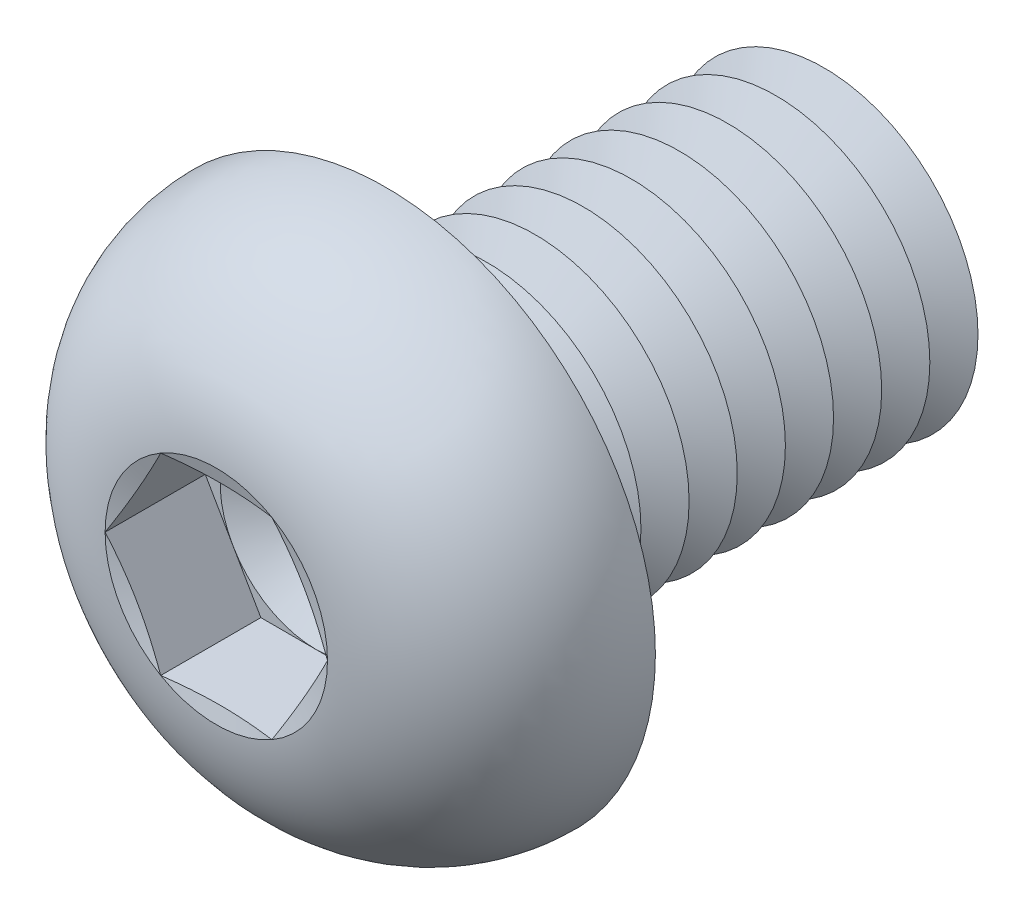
ISO-10303-21;
HEADER;
FILE_DESCRIPTION(('STEP AP214'),'2;1');
FILE_NAME('part.step','',(''),(''),'','','');
FILE_SCHEMA(('AUTOMOTIVE_DESIGN { 1 0 10303 214 1 1 1 1 }'));
ENDSEC;
DATA;
#1=APPLICATION_CONTEXT('core data for automotive mechanical design processes');
#2=APPLICATION_PROTOCOL_DEFINITION('international standard','automotive_design',2000,#1);
#3=PRODUCT_CONTEXT('',#1,'mechanical');
#4=PRODUCT('Part','Part','',(#3));
#5=PRODUCT_RELATED_PRODUCT_CATEGORY('part','',(#4));
#6=PRODUCT_DEFINITION_FORMATION('','',#4);
#7=PRODUCT_DEFINITION_CONTEXT('part definition',#1,'design');
#8=PRODUCT_DEFINITION('design','',#6,#7);
#9=PRODUCT_DEFINITION_SHAPE('','',#8);
#10=(LENGTH_UNIT() NAMED_UNIT(*) SI_UNIT(.MILLI.,.METRE.));
#11=(NAMED_UNIT(*) PLANE_ANGLE_UNIT() SI_UNIT($,.RADIAN.));
#12=(NAMED_UNIT(*) SI_UNIT($,.STERADIAN.) SOLID_ANGLE_UNIT());
#13=UNCERTAINTY_MEASURE_WITH_UNIT(LENGTH_MEASURE(1.E-05),#10,'distance_accuracy_value','');
#14=(GEOMETRIC_REPRESENTATION_CONTEXT(3) GLOBAL_UNCERTAINTY_ASSIGNED_CONTEXT((#13)) GLOBAL_UNIT_ASSIGNED_CONTEXT((#10,
#11,#12)) REPRESENTATION_CONTEXT('',''));
#15=CARTESIAN_POINT('',(0.,0.,0.));
#16=DIRECTION('',(0.,0.,1.));
#17=DIRECTION('',(1.,0.,0.));
#18=AXIS2_PLACEMENT_3D('',#15,#16,#17);
#19=CARTESIAN_POINT('',(0.,0.,1.8));
#20=DIRECTION('',(0.,0.,1.));
#21=DIRECTION('',(1.,0.,0.));
#22=AXIS2_PLACEMENT_3D('',#19,#20,#21);
#23=PLANE('',#22);
#24=CARTESIAN_POINT('',(0.,0.,1.8));
#25=DIRECTION('',(0.,0.,1.));
#26=DIRECTION('',(1.,0.,0.));
#27=AXIS2_PLACEMENT_3D('',#24,#25,#26);
#28=CIRCLE('',#27,2.49999883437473);
#29=CARTESIAN_POINT('',(2.1650625,1.24999941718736,1.8));
#30=VERTEX_POINT('',#29);
#31=CARTESIAN_POINT('',(0.,2.49999883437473,1.8));
#32=VERTEX_POINT('',#31);
#33=EDGE_CURVE('E118',#30,#32,#28,.T.);
#34=ORIENTED_EDGE('',*,*,#33,.F.);
#35=DIRECTION('',(-0.5,0.866025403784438,0.));
#36=VECTOR('',#35,1.);
#37=CARTESIAN_POINT('',(2.88675,0.,1.8));
#38=LINE('',#37,#36);
#39=CARTESIAN_POINT('',(1.443375,2.49999883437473,1.8));
#40=VERTEX_POINT('',#39);
#41=EDGE_CURVE('E125',#30,#40,#38,.T.);
#42=ORIENTED_EDGE('',*,*,#41,.T.);
#43=DIRECTION('',(-1.,0.,0.));
#44=VECTOR('',#43,1.);
#45=CARTESIAN_POINT('',(1.443375,2.49999883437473,1.8));
#46=LINE('',#45,#44);
#47=EDGE_CURVE('E136',#40,#32,#46,.T.);
#48=ORIENTED_EDGE('',*,*,#47,.T.);
#49=EDGE_LOOP('',(#34,#42,#48));
#50=FACE_BOUND('',#49,.T.);
#51=ADVANCED_FACE('F39',(#50),#23,.T.);
#52=CARTESIAN_POINT('',(0.,0.,1.8));
#53=DIRECTION('',(0.,0.,1.));
#54=DIRECTION('',(1.,0.,0.));
#55=AXIS2_PLACEMENT_3D('',#52,#53,#54);
#56=CIRCLE('',#55,2.49999883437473);
#57=CARTESIAN_POINT('',(-2.1650625,1.24999941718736,1.8));
#58=VERTEX_POINT('',#57);
#59=EDGE_CURVE('E11',#32,#58,#56,.T.);
#60=ORIENTED_EDGE('',*,*,#59,.F.);
#61=CARTESIAN_POINT('',(-1.443375,2.49999883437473,1.8));
#62=VERTEX_POINT('',#61);
#63=EDGE_CURVE('E131',#32,#62,#46,.T.);
#64=ORIENTED_EDGE('',*,*,#63,.T.);
#65=DIRECTION('',(-0.5,-0.866025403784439,0.));
#66=VECTOR('',#65,1.);
#67=CARTESIAN_POINT('',(-1.443375,2.49999883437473,1.8));
#68=LINE('',#67,#66);
#69=EDGE_CURVE('E134',#62,#58,#68,.T.);
#70=ORIENTED_EDGE('',*,*,#69,.T.);
#71=EDGE_LOOP('',(#60,#64,#70));
#72=FACE_BOUND('',#71,.T.);
#73=ADVANCED_FACE('F130',(#72),#23,.T.);
#74=CARTESIAN_POINT('',(-2.1650625,-1.24999941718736,1.8));
#75=VERTEX_POINT('',#74);
#76=EDGE_CURVE('E49',#58,#75,#56,.T.);
#77=ORIENTED_EDGE('',*,*,#76,.F.);
#78=CARTESIAN_POINT('',(-2.88675,0.,1.8));
#79=VERTEX_POINT('',#78);
#80=EDGE_CURVE('E143',#58,#79,#68,.T.);
#81=ORIENTED_EDGE('',*,*,#80,.T.);
#82=DIRECTION('',(0.5,-0.866025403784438,0.));
#83=VECTOR('',#82,1.);
#84=CARTESIAN_POINT('',(-2.88675,0.,1.8));
#85=LINE('',#84,#83);
#86=EDGE_CURVE('E151',#79,#75,#85,.T.);
#87=ORIENTED_EDGE('',*,*,#86,.T.);
#88=EDGE_LOOP('',(#77,#81,#87));
#89=FACE_BOUND('',#88,.T.);
#90=ADVANCED_FACE('F345',(#89),#23,.T.);
#91=CARTESIAN_POINT('',(0.,-2.49999883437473,1.8));
#92=VERTEX_POINT('',#91);
#93=EDGE_CURVE('E328',#75,#92,#56,.T.);
#94=ORIENTED_EDGE('',*,*,#93,.F.);
#95=CARTESIAN_POINT('',(-1.443375,-2.49999883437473,1.8));
#96=VERTEX_POINT('',#95);
#97=EDGE_CURVE('E150',#75,#96,#85,.T.);
#98=ORIENTED_EDGE('',*,*,#97,.T.);
#99=DIRECTION('',(1.,0.,0.));
#100=VECTOR('',#99,1.);
#101=CARTESIAN_POINT('',(-1.443375,-2.49999883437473,1.8));
#102=LINE('',#101,#100);
#103=EDGE_CURVE('E156',#96,#92,#102,.T.);
#104=ORIENTED_EDGE('',*,*,#103,.T.);
#105=EDGE_LOOP('',(#94,#98,#104));
#106=FACE_BOUND('',#105,.T.);
#107=ADVANCED_FACE('F339',(#106),#23,.T.);
#108=CARTESIAN_POINT('',(2.1650625,-1.24999941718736,1.8));
#109=VERTEX_POINT('',#108);
#110=EDGE_CURVE('E56',#92,#109,#56,.T.);
#111=ORIENTED_EDGE('',*,*,#110,.F.);
#112=CARTESIAN_POINT('',(1.443375,-2.49999883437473,1.8));
#113=VERTEX_POINT('',#112);
#114=EDGE_CURVE('E155',#92,#113,#102,.T.);
#115=ORIENTED_EDGE('',*,*,#114,.T.);
#116=DIRECTION('',(0.5,0.866025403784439,0.));
#117=VECTOR('',#116,1.);
#118=CARTESIAN_POINT('',(1.443375,-2.49999883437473,1.8));
#119=LINE('',#118,#117);
#120=EDGE_CURVE('E161',#113,#109,#119,.T.);
#121=ORIENTED_EDGE('',*,*,#120,.T.);
#122=EDGE_LOOP('',(#111,#115,#121));
#123=FACE_BOUND('',#122,.T.);
#124=ADVANCED_FACE('F419',(#123),#23,.T.);
#125=CARTESIAN_POINT('',(0.,0.,4.4));
#126=DIRECTION('',(0.,0.,1.));
#127=DIRECTION('',(1.,0.,0.));
#128=AXIS2_PLACEMENT_3D('',#125,#126,#127);
#129=CONICAL_SURFACE('',#128,2.88675,1.30899693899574);
#130=CARTESIAN_POINT('',(2.88686547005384,-0.000199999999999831,4.40003094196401));
#131=CARTESIAN_POINT('',(2.82691617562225,0.103635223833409,4.3839595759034));
#132=CARTESIAN_POINT('',(2.76685817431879,0.207658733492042,4.36936933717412));
#133=CARTESIAN_POINT('',(2.64653003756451,0.416073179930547,4.3437355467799));
#134=CARTESIAN_POINT('',(2.58625982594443,0.520464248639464,4.33269343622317));
#135=CARTESIAN_POINT('',(2.46587274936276,0.728980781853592,4.31480063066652));
#136=CARTESIAN_POINT('',(2.40575669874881,0.833104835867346,4.3079285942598));
#137=CARTESIAN_POINT('',(2.28544792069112,1.0414857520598,4.29871388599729));
#138=CARTESIAN_POINT('',(2.22525521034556,1.14574258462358,4.29637033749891));
#139=CARTESIAN_POINT('',(2.10486978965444,1.35425624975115,4.29637033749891));
#140=CARTESIAN_POINT('',(2.04467707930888,1.45851308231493,4.29871388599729));
#141=CARTESIAN_POINT('',(1.92436830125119,1.66689399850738,4.3079285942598));
#142=CARTESIAN_POINT('',(1.86425225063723,1.77101805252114,4.31480063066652));
#143=CARTESIAN_POINT('',(1.74386517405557,1.97953458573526,4.33269343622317));
#144=CARTESIAN_POINT('',(1.68359496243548,2.08392565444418,4.3437355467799));
#145=CARTESIAN_POINT('',(1.56326682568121,2.29234010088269,4.36936933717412));
#146=CARTESIAN_POINT('',(1.50320882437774,2.39636361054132,4.3839595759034));
#147=CARTESIAN_POINT('',(1.44325952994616,2.50019883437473,4.40003094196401));
#148=B_SPLINE_CURVE_WITH_KNOTS('',3,(#130,#131,#132,#133,#134,#135,#136,#137,#138,#139,#140,
#141,#142,#143,#144,#145,#146,#147),.UNSPECIFIED.,.F.,.F.,(4,2,2,2,2,2,2,2,4),(0.,
0.362931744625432,0.726010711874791,1.08721550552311,1.44835036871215,1.80948523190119,
2.17069002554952,2.53376899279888,2.89670073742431),.UNSPECIFIED.);
#149=CARTESIAN_POINT('',(2.88675,0.,4.4));
#150=VERTEX_POINT('',#149);
#151=CARTESIAN_POINT('',(1.44337499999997,2.49999883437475,4.4));
#152=VERTEX_POINT('',#151);
#153=EDGE_CURVE('E221',#150,#152,#148,.T.);
#154=ORIENTED_EDGE('',*,*,#153,.F.);
#155=CARTESIAN_POINT('',(0.,0.,4.4));
#156=DIRECTION('',(0.,0.,-1.));
#157=DIRECTION('',(-1.,0.,0.));
#158=AXIS2_PLACEMENT_3D('',#155,#156,#157);
#159=CIRCLE('',#158,2.88675);
#160=EDGE_CURVE('E375',#152,#150,#159,.T.);
#161=ORIENTED_EDGE('',*,*,#160,.F.);
#162=EDGE_LOOP('',(#154,#161));
#163=FACE_BOUND('',#162,.T.);
#164=ADVANCED_FACE('F423',(#163),#129,.F.);
#165=CARTESIAN_POINT('',(1.44325952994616,-2.50019883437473,4.40003094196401));
#166=CARTESIAN_POINT('',(1.50320882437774,-2.39636361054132,4.3839595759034));
#167=CARTESIAN_POINT('',(1.56326682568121,-2.29234010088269,4.36936933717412));
#168=CARTESIAN_POINT('',(1.68359496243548,-2.08392565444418,4.3437355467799));
#169=CARTESIAN_POINT('',(1.74386517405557,-1.97953458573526,4.33269343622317));
#170=CARTESIAN_POINT('',(1.86425225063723,-1.77101805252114,4.31480063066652));
#171=CARTESIAN_POINT('',(1.92436830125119,-1.66689399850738,4.3079285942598));
#172=CARTESIAN_POINT('',(2.04467707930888,-1.45851308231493,4.29871388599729));
#173=CARTESIAN_POINT('',(2.10486978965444,-1.35425624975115,4.29637033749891));
#174=CARTESIAN_POINT('',(2.22525521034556,-1.14574258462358,4.29637033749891));
#175=CARTESIAN_POINT('',(2.28544792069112,-1.0414857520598,4.29871388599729));
#176=CARTESIAN_POINT('',(2.40575669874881,-0.833104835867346,4.3079285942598));
#177=CARTESIAN_POINT('',(2.46587274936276,-0.728980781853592,4.31480063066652));
#178=CARTESIAN_POINT('',(2.58625982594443,-0.520464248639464,4.33269343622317));
#179=CARTESIAN_POINT('',(2.64653003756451,-0.416073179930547,4.3437355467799));
#180=CARTESIAN_POINT('',(2.76685817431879,-0.207658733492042,4.36936933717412));
#181=CARTESIAN_POINT('',(2.82691617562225,-0.103635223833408,4.3839595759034));
#182=CARTESIAN_POINT('',(2.88686547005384,0.000200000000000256,4.40003094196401));
#183=B_SPLINE_CURVE_WITH_KNOTS('',3,(#165,#166,#167,#168,#169,#170,#171,#172,#173,#174,#175,
#176,#177,#178,#179,#180,#181,#182),.UNSPECIFIED.,.F.,.F.,(4,2,2,2,2,2,2,2,4),(0.,
0.362931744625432,0.726010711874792,1.08721550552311,1.44835036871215,1.80948523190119,
2.17069002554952,2.53376899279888,2.89670073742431),.UNSPECIFIED.);
#184=CARTESIAN_POINT('',(1.443375,-2.49999883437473,4.4));
#185=VERTEX_POINT('',#184);
#186=EDGE_CURVE('E230',#185,#150,#183,.T.);
#187=ORIENTED_EDGE('',*,*,#186,.F.);
#188=EDGE_CURVE('E378',#150,#185,#159,.T.);
#189=ORIENTED_EDGE('',*,*,#188,.F.);
#190=EDGE_LOOP('',(#187,#189));
#191=FACE_BOUND('',#190,.T.);
#192=ADVANCED_FACE('F384',(#191),#129,.F.);
#193=CARTESIAN_POINT('',(-4.35611719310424,-2.49999883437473,4.97227902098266));
#194=CARTESIAN_POINT('',(-4.25066509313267,-2.49999883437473,4.94777440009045));
#195=CARTESIAN_POINT('',(-4.14516541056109,-2.49999883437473,4.92347459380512));
#196=CARTESIAN_POINT('',(-3.93405094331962,-2.49999883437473,4.87537247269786));
#197=CARTESIAN_POINT('',(-3.82843615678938,-2.49999883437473,4.85157016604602));
#198=CARTESIAN_POINT('',(-3.5113534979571,-2.49999883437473,4.78103338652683));
#199=CARTESIAN_POINT('',(-3.29968815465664,-2.49999883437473,4.73517861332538));
#200=CARTESIAN_POINT('',(-2.87365524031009,-2.49999883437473,4.64645582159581));
#201=CARTESIAN_POINT('',(-2.65928093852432,-2.49999883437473,4.60361983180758));
#202=CARTESIAN_POINT('',(-2.22952626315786,-2.49999883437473,4.52311285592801));
#203=CARTESIAN_POINT('',(-2.01414580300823,-2.49999883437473,4.48544232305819));
#204=CARTESIAN_POINT('',(-1.58798319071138,-2.49999883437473,4.41876559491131));
#205=CARTESIAN_POINT('',(-1.37723418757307,-2.49999883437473,4.38955265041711));
#206=CARTESIAN_POINT('',(-0.954530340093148,-2.49999883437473,4.34171384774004));
#207=CARTESIAN_POINT('',(-0.742575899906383,-2.49999883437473,4.32308463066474));
#208=CARTESIAN_POINT('',(-0.424544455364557,-2.49999883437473,4.30539140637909));
#209=CARTESIAN_POINT('',(-0.318745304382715,-2.49999883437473,4.30120018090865));
#210=CARTESIAN_POINT('',(-0.107062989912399,-2.49999883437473,4.29638997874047));
#211=CARTESIAN_POINT('',(-0.00117982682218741,-2.49999883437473,4.29577098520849));
#212=CARTESIAN_POINT('',(0.210552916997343,-2.49999883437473,4.29814378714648));
#213=CARTESIAN_POINT('',(0.316402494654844,-2.49999883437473,4.30113585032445));
#214=CARTESIAN_POINT('',(0.527944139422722,-2.49999883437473,4.31057322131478));
#215=CARTESIAN_POINT('',(0.633636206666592,-2.49999883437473,4.31701852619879));
#216=CARTESIAN_POINT('',(0.890304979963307,-2.49999883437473,4.33652018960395));
#217=CARTESIAN_POINT('',(1.0411561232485,-2.49999883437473,4.35122885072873));
#218=CARTESIAN_POINT('',(1.34222474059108,-2.49999883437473,4.38593609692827));
#219=CARTESIAN_POINT('',(1.49244223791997,-2.49999883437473,4.40593448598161));
#220=CARTESIAN_POINT('',(1.79273634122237,-2.49999883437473,4.45011321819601));
#221=CARTESIAN_POINT('',(1.94281100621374,-2.49999883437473,4.47430656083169));
#222=CARTESIAN_POINT('',(2.24242097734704,-2.49999883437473,4.52583552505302));
#223=CARTESIAN_POINT('',(2.39195625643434,-2.49999883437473,4.55317130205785));
#224=CARTESIAN_POINT('',(2.69364402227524,-2.49999883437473,4.61079781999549));
#225=CARTESIAN_POINT('',(2.8457870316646,-2.49999883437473,4.64113779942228));
#226=CARTESIAN_POINT('',(3.14969016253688,-2.49999883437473,4.70367638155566));
#227=CARTESIAN_POINT('',(3.30145027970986,-2.49999883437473,4.73587500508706));
#228=CARTESIAN_POINT('',(3.60383766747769,-2.49999883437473,4.80150275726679));
#229=CARTESIAN_POINT('',(3.75446660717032,-2.49999883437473,4.83492423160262));
#230=CARTESIAN_POINT('',(4.05546753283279,-2.49999883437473,4.90285814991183));
#231=CARTESIAN_POINT('',(4.2058395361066,-2.49999883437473,4.9373705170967));
#232=CARTESIAN_POINT('',(4.35611719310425,-2.49999883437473,4.97227902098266));
#233=B_SPLINE_CURVE_WITH_KNOTS('',3,(#193,#194,#195,#196,#197,#198,#199,#200,#201,#202,#203,
#204,#205,#206,#207,#208,#209,#210,#211,#212,#213,#214,#215,#216,#217,#218,#219,#220,#221,#222,
#223,#224,#225,#226,#227,#228,#229,#230,#231,#232),.UNSPECIFIED.,.F.,.F.,(4,2,2,2,2,2,2,2,2,2,2,
2,2,2,2,2,2,2,2,4),(0.,0.324785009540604,0.6495753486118,1.29928181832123,1.95507889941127,
2.61093348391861,3.24905289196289,3.88696967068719,4.204563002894,4.5221548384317,
4.83977022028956,5.15738533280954,5.61196030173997,6.06651842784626,6.52251118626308,
6.97852650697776,7.44392737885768,7.90933346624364,8.37220553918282,8.83504510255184),.UNSPECIFIED.);
#234=CARTESIAN_POINT('',(-1.443375,-2.49999883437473,4.4));
#235=VERTEX_POINT('',#234);
#236=EDGE_CURVE('E357',#235,#185,#233,.T.);
#237=ORIENTED_EDGE('',*,*,#236,.F.);
#238=EDGE_CURVE('E365',#185,#235,#159,.T.);
#239=ORIENTED_EDGE('',*,*,#238,.F.);
#240=EDGE_LOOP('',(#237,#239));
#241=FACE_BOUND('',#240,.T.);
#242=ADVANCED_FACE('F390',(#241),#129,.F.);
#243=CARTESIAN_POINT('',(-2.88686547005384,0.000200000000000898,4.40003094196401));
#244=CARTESIAN_POINT('',(-2.82691617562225,-0.103635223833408,4.3839595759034));
#245=CARTESIAN_POINT('',(-2.76685817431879,-0.207658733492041,4.36936933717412));
#246=CARTESIAN_POINT('',(-2.64653003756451,-0.416073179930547,4.3437355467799));
#247=CARTESIAN_POINT('',(-2.58625982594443,-0.520464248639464,4.33269343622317));
#248=CARTESIAN_POINT('',(-2.46587274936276,-0.728980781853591,4.31480063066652));
#249=CARTESIAN_POINT('',(-2.40575669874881,-0.833104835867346,4.3079285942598));
#250=CARTESIAN_POINT('',(-2.28544792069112,-1.0414857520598,4.29871388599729));
#251=CARTESIAN_POINT('',(-2.22525521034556,-1.14574258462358,4.29637033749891));
#252=CARTESIAN_POINT('',(-2.10486978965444,-1.35425624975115,4.29637033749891));
#253=CARTESIAN_POINT('',(-2.04467707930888,-1.45851308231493,4.29871388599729));
#254=CARTESIAN_POINT('',(-1.92436830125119,-1.66689399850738,4.3079285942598));
#255=CARTESIAN_POINT('',(-1.86425225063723,-1.77101805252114,4.31480063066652));
#256=CARTESIAN_POINT('',(-1.74386517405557,-1.97953458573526,4.33269343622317));
#257=CARTESIAN_POINT('',(-1.68359496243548,-2.08392565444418,4.3437355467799));
#258=CARTESIAN_POINT('',(-1.56326682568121,-2.29234010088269,4.36936933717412));
#259=CARTESIAN_POINT('',(-1.50320882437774,-2.39636361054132,4.3839595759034));
#260=CARTESIAN_POINT('',(-1.44325952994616,-2.50019883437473,4.40003094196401));
#261=B_SPLINE_CURVE_WITH_KNOTS('',3,(#243,#244,#245,#246,#247,#248,#249,#250,#251,#252,#253,
#254,#255,#256,#257,#258,#259,#260),.UNSPECIFIED.,.F.,.F.,(4,2,2,2,2,2,2,2,4),(0.,
0.362931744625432,0.726010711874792,1.08721550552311,1.44835036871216,1.8094852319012,
2.17069002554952,2.53376899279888,2.89670073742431),.UNSPECIFIED.);
#262=CARTESIAN_POINT('',(-2.88675,0.,4.4));
#263=VERTEX_POINT('',#262);
#264=EDGE_CURVE('E350',#263,#235,#261,.T.);
#265=ORIENTED_EDGE('',*,*,#264,.F.);
#266=EDGE_CURVE('E308',#235,#263,#159,.T.);
#267=ORIENTED_EDGE('',*,*,#266,.F.);
#268=EDGE_LOOP('',(#265,#267));
#269=FACE_BOUND('',#268,.T.);
#270=ADVANCED_FACE('F354',(#269),#129,.F.);
#271=CARTESIAN_POINT('',(-1.44325952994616,2.50019883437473,4.40003094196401));
#272=CARTESIAN_POINT('',(-1.50320882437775,2.39636361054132,4.3839595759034));
#273=CARTESIAN_POINT('',(-1.56326682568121,2.29234010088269,4.36936933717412));
#274=CARTESIAN_POINT('',(-1.68359496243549,2.08392565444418,4.3437355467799));
#275=CARTESIAN_POINT('',(-1.74386517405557,1.97953458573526,4.33269343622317));
#276=CARTESIAN_POINT('',(-1.86425225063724,1.77101805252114,4.31480063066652));
#277=CARTESIAN_POINT('',(-1.92436830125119,1.66689399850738,4.3079285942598));
#278=CARTESIAN_POINT('',(-2.04467707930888,1.45851308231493,4.29871388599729));
#279=CARTESIAN_POINT('',(-2.10486978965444,1.35425624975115,4.29637033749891));
#280=CARTESIAN_POINT('',(-2.22525521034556,1.14574258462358,4.29637033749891));
#281=CARTESIAN_POINT('',(-2.28544792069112,1.0414857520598,4.29871388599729));
#282=CARTESIAN_POINT('',(-2.40575669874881,0.833104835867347,4.3079285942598));
#283=CARTESIAN_POINT('',(-2.46587274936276,0.728980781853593,4.31480063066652));
#284=CARTESIAN_POINT('',(-2.58625982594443,0.520464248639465,4.33269343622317));
#285=CARTESIAN_POINT('',(-2.64653003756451,0.416073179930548,4.3437355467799));
#286=CARTESIAN_POINT('',(-2.76685817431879,0.207658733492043,4.36936933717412));
#287=CARTESIAN_POINT('',(-2.82691617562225,0.10363522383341,4.3839595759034));
#288=CARTESIAN_POINT('',(-2.88686547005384,-0.000199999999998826,4.40003094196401));
#289=B_SPLINE_CURVE_WITH_KNOTS('',3,(#271,#272,#273,#274,#275,#276,#277,#278,#279,#280,#281,
#282,#283,#284,#285,#286,#287,#288),.UNSPECIFIED.,.F.,.F.,(4,2,2,2,2,2,2,2,4),(0.,
0.362931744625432,0.726010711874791,1.08721550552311,1.44835036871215,1.80948523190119,
2.17069002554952,2.53376899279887,2.89670073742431),.UNSPECIFIED.);
#290=CARTESIAN_POINT('',(-1.443375,2.49999883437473,4.4));
#291=VERTEX_POINT('',#290);
#292=EDGE_CURVE('E194',#291,#263,#289,.T.);
#293=ORIENTED_EDGE('',*,*,#292,.F.);
#294=EDGE_CURVE('E309',#263,#291,#159,.T.);
#295=ORIENTED_EDGE('',*,*,#294,.F.);
#296=EDGE_LOOP('',(#293,#295));
#297=FACE_BOUND('',#296,.T.);
#298=ADVANCED_FACE('F368',(#297),#129,.F.);
#299=CARTESIAN_POINT('',(0.,0.,-7.625));
#300=DIRECTION('',(0.,0.,1.));
#301=DIRECTION('',(1.,0.,0.));
#302=AXIS2_PLACEMENT_3D('',#299,#300,#301);
#303=CONICAL_SURFACE('',#302,4.,1.0471975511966);
#304=CARTESIAN_POINT('',(0.,0.,-8.25));
#305=DIRECTION('',(0.,0.,1.));
#306=DIRECTION('',(1.,0.,0.));
#307=AXIS2_PLACEMENT_3D('',#304,#305,#306);
#308=CIRCLE('',#307,2.91746824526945);
#309=CARTESIAN_POINT('',(2.91746824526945,0.,-8.25));
#310=VERTEX_POINT('',#309);
#311=EDGE_CURVE('E280',#310,#310,#308,.T.);
#312=ORIENTED_EDGE('',*,*,#311,.T.);
#313=EDGE_LOOP('',(#312));
#314=FACE_BOUND('',#313,.T.);
#315=CARTESIAN_POINT('',(0.,0.,-7.625));
#316=DIRECTION('',(0.,0.,1.));
#317=DIRECTION('',(1.,0.,0.));
#318=AXIS2_PLACEMENT_3D('',#315,#316,#317);
#319=CIRCLE('',#318,4.);
#320=CARTESIAN_POINT('',(4.,0.,-7.625));
#321=VERTEX_POINT('',#320);
#322=EDGE_CURVE('E276',#321,#321,#319,.T.);
#323=ORIENTED_EDGE('',*,*,#322,.F.);
#324=EDGE_LOOP('',(#323));
#325=FACE_BOUND('',#324,.T.);
#326=ADVANCED_FACE('F555',(#314,#325),#303,.T.);
#327=CARTESIAN_POINT('',(0.,0.,-8.25));
#328=DIRECTION('',(0.,0.,-1.));
#329=DIRECTION('',(-1.,0.,0.));
#330=AXIS2_PLACEMENT_3D('',#327,#328,#329);
#331=CONICAL_SURFACE('',#330,2.91746824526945,1.0471975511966);
#332=CARTESIAN_POINT('',(0.,0.,-8.875));
#333=DIRECTION('',(0.,0.,1.));
#334=DIRECTION('',(1.,0.,0.));
#335=AXIS2_PLACEMENT_3D('',#332,#333,#334);
#336=CIRCLE('',#335,4.);
#337=CARTESIAN_POINT('',(4.,0.,-8.875));
#338=VERTEX_POINT('',#337);
#339=EDGE_CURVE('E284',#338,#338,#336,.T.);
#340=ORIENTED_EDGE('',*,*,#339,.T.);
#341=EDGE_LOOP('',(#340));
#342=FACE_BOUND('',#341,.T.);
#343=ORIENTED_EDGE('',*,*,#311,.F.);
#344=EDGE_LOOP('',(#343));
#345=FACE_BOUND('',#344,.T.);
#346=ADVANCED_FACE('F698',(#342,#345),#331,.T.);
#347=CARTESIAN_POINT('',(0.,4.00000000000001,-12.));
#348=DIRECTION('',(0.,0.,-1.));
#349=DIRECTION('',(-1.,0.,0.));
#350=AXIS2_PLACEMENT_3D('',#347,#348,#349);
#351=PLANE('',#350);
#352=CARTESIAN_POINT('',(0.,0.,-12.));
#353=DIRECTION('',(0.,0.,1.));
#354=DIRECTION('',(1.,0.,0.));
#355=AXIS2_PLACEMENT_3D('',#352,#353,#354);
#356=CIRCLE('',#355,2.91746824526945);
#357=CARTESIAN_POINT('',(2.91746824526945,0.,-12.));
#358=VERTEX_POINT('',#357);
#359=EDGE_CURVE('E304',#358,#358,#356,.T.);
#360=ORIENTED_EDGE('',*,*,#359,.F.);
#361=EDGE_LOOP('',(#360));
#362=FACE_BOUND('',#361,.T.);
#363=ADVANCED_FACE('F703',(#362),#351,.T.);
#364=CARTESIAN_POINT('',(0.,0.,-11.375));
#365=DIRECTION('',(0.,0.,1.));
#366=DIRECTION('',(1.,0.,0.));
#367=AXIS2_PLACEMENT_3D('',#364,#365,#366);
#368=CONICAL_SURFACE('',#367,4.,1.0471975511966);
#369=ORIENTED_EDGE('',*,*,#359,.T.);
#370=EDGE_LOOP('',(#369));
#371=FACE_BOUND('',#370,.T.);
#372=CARTESIAN_POINT('',(0.,0.,-11.375));
#373=DIRECTION('',(0.,0.,1.));
#374=DIRECTION('',(1.,0.,0.));
#375=AXIS2_PLACEMENT_3D('',#372,#373,#374);
#376=CIRCLE('',#375,4.);
#377=CARTESIAN_POINT('',(4.,0.,-11.375));
#378=VERTEX_POINT('',#377);
#379=EDGE_CURVE('E300',#378,#378,#376,.T.);
#380=ORIENTED_EDGE('',*,*,#379,.F.);
#381=EDGE_LOOP('',(#380));
#382=FACE_BOUND('',#381,.T.);
#383=ADVANCED_FACE('F692',(#371,#382),#368,.T.);
#384=CARTESIAN_POINT('',(0.,0.,-10.75));
#385=DIRECTION('',(0.,0.,-1.));
#386=DIRECTION('',(-1.,0.,0.));
#387=AXIS2_PLACEMENT_3D('',#384,#385,#386);
#388=CONICAL_SURFACE('',#387,2.91746824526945,1.0471975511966);
#389=ORIENTED_EDGE('',*,*,#379,.T.);
#390=EDGE_LOOP('',(#389));
#391=FACE_BOUND('',#390,.T.);
#392=CARTESIAN_POINT('',(0.,0.,-10.75));
#393=DIRECTION('',(0.,0.,1.));
#394=DIRECTION('',(1.,0.,0.));
#395=AXIS2_PLACEMENT_3D('',#392,#393,#394);
#396=CIRCLE('',#395,2.91746824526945);
#397=CARTESIAN_POINT('',(2.91746824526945,0.,-10.75));
#398=VERTEX_POINT('',#397);
#399=EDGE_CURVE('E296',#398,#398,#396,.T.);
#400=ORIENTED_EDGE('',*,*,#399,.F.);
#401=EDGE_LOOP('',(#400));
#402=FACE_BOUND('',#401,.T.);
#403=ADVANCED_FACE('F682',(#391,#402),#388,.T.);
#404=CARTESIAN_POINT('',(0.,0.,-10.125));
#405=DIRECTION('',(0.,0.,1.));
#406=DIRECTION('',(1.,0.,0.));
#407=AXIS2_PLACEMENT_3D('',#404,#405,#406);
#408=CONICAL_SURFACE('',#407,4.,1.0471975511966);
#409=ORIENTED_EDGE('',*,*,#399,.T.);
#410=EDGE_LOOP('',(#409));
#411=FACE_BOUND('',#410,.T.);
#412=CARTESIAN_POINT('',(0.,0.,-10.125));
#413=DIRECTION('',(0.,0.,1.));
#414=DIRECTION('',(1.,0.,0.));
#415=AXIS2_PLACEMENT_3D('',#412,#413,#414);
#416=CIRCLE('',#415,4.);
#417=CARTESIAN_POINT('',(4.,0.,-10.125));
#418=VERTEX_POINT('',#417);
#419=EDGE_CURVE('E292',#418,#418,#416,.T.);
#420=ORIENTED_EDGE('',*,*,#419,.F.);
#421=EDGE_LOOP('',(#420));
#422=FACE_BOUND('',#421,.T.);
#423=ADVANCED_FACE('F672',(#411,#422),#408,.T.);
#424=CARTESIAN_POINT('',(0.,0.,-9.5));
#425=DIRECTION('',(0.,0.,-1.));
#426=DIRECTION('',(-1.,0.,0.));
#427=AXIS2_PLACEMENT_3D('',#424,#425,#426);
#428=CONICAL_SURFACE('',#427,2.91746824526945,1.0471975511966);
#429=ORIENTED_EDGE('',*,*,#419,.T.);
#430=EDGE_LOOP('',(#429));
#431=FACE_BOUND('',#430,.T.);
#432=CARTESIAN_POINT('',(0.,0.,-9.5));
#433=DIRECTION('',(0.,0.,1.));
#434=DIRECTION('',(1.,0.,0.));
#435=AXIS2_PLACEMENT_3D('',#432,#433,#434);
#436=CIRCLE('',#435,2.91746824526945);
#437=CARTESIAN_POINT('',(2.91746824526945,0.,-9.5));
#438=VERTEX_POINT('',#437);
#439=EDGE_CURVE('E288',#438,#438,#436,.T.);
#440=ORIENTED_EDGE('',*,*,#439,.F.);
#441=EDGE_LOOP('',(#440));
#442=FACE_BOUND('',#441,.T.);
#443=ADVANCED_FACE('F662',(#431,#442),#428,.T.);
#444=CARTESIAN_POINT('',(0.,0.,-8.875));
#445=DIRECTION('',(0.,0.,1.));
#446=DIRECTION('',(1.,0.,0.));
#447=AXIS2_PLACEMENT_3D('',#444,#445,#446);
#448=CONICAL_SURFACE('',#447,4.,1.0471975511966);
#449=ORIENTED_EDGE('',*,*,#439,.T.);
#450=EDGE_LOOP('',(#449));
#451=FACE_BOUND('',#450,.T.);
#452=ORIENTED_EDGE('',*,*,#339,.F.);
#453=EDGE_LOOP('',(#452));
#454=FACE_BOUND('',#453,.T.);
#455=ADVANCED_FACE('F652',(#451,#454),#448,.T.);
#456=CARTESIAN_POINT('',(0.,0.,-6.375));
#457=DIRECTION('',(0.,0.,1.));
#458=DIRECTION('',(1.,0.,0.));
#459=AXIS2_PLACEMENT_3D('',#456,#457,#458);
#460=CONICAL_SURFACE('',#459,4.,1.0471975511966);
#461=CARTESIAN_POINT('',(0.,0.,-7.));
#462=DIRECTION('',(0.,0.,1.));
#463=DIRECTION('',(1.,0.,0.));
#464=AXIS2_PLACEMENT_3D('',#461,#462,#463);
#465=CIRCLE('',#464,2.91746824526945);
#466=CARTESIAN_POINT('',(2.91746824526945,0.,-7.));
#467=VERTEX_POINT('',#466);
#468=EDGE_CURVE('E272',#467,#467,#465,.T.);
#469=ORIENTED_EDGE('',*,*,#468,.T.);
#470=EDGE_LOOP('',(#469));
#471=FACE_BOUND('',#470,.T.);
#472=CARTESIAN_POINT('',(0.,0.,-6.375));
#473=DIRECTION('',(0.,0.,1.));
#474=DIRECTION('',(1.,0.,0.));
#475=AXIS2_PLACEMENT_3D('',#472,#473,#474);
#476=CIRCLE('',#475,4.);
#477=CARTESIAN_POINT('',(4.,0.,-6.375));
#478=VERTEX_POINT('',#477);
#479=EDGE_CURVE('E268',#478,#478,#476,.T.);
#480=ORIENTED_EDGE('',*,*,#479,.F.);
#481=EDGE_LOOP('',(#480));
#482=FACE_BOUND('',#481,.T.);
#483=ADVANCED_FACE('F642',(#471,#482),#460,.T.);
#484=CARTESIAN_POINT('',(0.,0.,-7.));
#485=DIRECTION('',(0.,0.,-1.));
#486=DIRECTION('',(-1.,0.,0.));
#487=AXIS2_PLACEMENT_3D('',#484,#485,#486);
#488=CONICAL_SURFACE('',#487,2.91746824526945,1.0471975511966);
#489=ORIENTED_EDGE('',*,*,#322,.T.);
#490=EDGE_LOOP('',(#489));
#491=FACE_BOUND('',#490,.T.);
#492=ORIENTED_EDGE('',*,*,#468,.F.);
#493=EDGE_LOOP('',(#492));
#494=FACE_BOUND('',#493,.T.);
#495=ADVANCED_FACE('F632',(#491,#494),#488,.T.);
#496=CARTESIAN_POINT('',(0.,0.,-5.125));
#497=DIRECTION('',(0.,0.,1.));
#498=DIRECTION('',(1.,0.,0.));
#499=AXIS2_PLACEMENT_3D('',#496,#497,#498);
#500=CONICAL_SURFACE('',#499,4.,1.0471975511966);
#501=CARTESIAN_POINT('',(0.,0.,-5.75));
#502=DIRECTION('',(0.,0.,1.));
#503=DIRECTION('',(1.,0.,0.));
#504=AXIS2_PLACEMENT_3D('',#501,#502,#503);
#505=CIRCLE('',#504,2.91746824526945);
#506=CARTESIAN_POINT('',(2.91746824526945,0.,-5.75));
#507=VERTEX_POINT('',#506);
#508=EDGE_CURVE('E264',#507,#507,#505,.T.);
#509=ORIENTED_EDGE('',*,*,#508,.T.);
#510=EDGE_LOOP('',(#509));
#511=FACE_BOUND('',#510,.T.);
#512=CARTESIAN_POINT('',(0.,0.,-5.125));
#513=DIRECTION('',(0.,0.,1.));
#514=DIRECTION('',(1.,0.,0.));
#515=AXIS2_PLACEMENT_3D('',#512,#513,#514);
#516=CIRCLE('',#515,4.);
#517=CARTESIAN_POINT('',(4.,0.,-5.125));
#518=VERTEX_POINT('',#517);
#519=EDGE_CURVE('E260',#518,#518,#516,.T.);
#520=ORIENTED_EDGE('',*,*,#519,.F.);
#521=EDGE_LOOP('',(#520));
#522=FACE_BOUND('',#521,.T.);
#523=ADVANCED_FACE('F622',(#511,#522),#500,.T.);
#524=CARTESIAN_POINT('',(0.,0.,-5.75));
#525=DIRECTION('',(0.,0.,-1.));
#526=DIRECTION('',(-1.,0.,0.));
#527=AXIS2_PLACEMENT_3D('',#524,#525,#526);
#528=CONICAL_SURFACE('',#527,2.91746824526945,1.0471975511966);
#529=ORIENTED_EDGE('',*,*,#479,.T.);
#530=EDGE_LOOP('',(#529));
#531=FACE_BOUND('',#530,.T.);
#532=ORIENTED_EDGE('',*,*,#508,.F.);
#533=EDGE_LOOP('',(#532));
#534=FACE_BOUND('',#533,.T.);
#535=ADVANCED_FACE('F612',(#531,#534),#528,.T.);
#536=CARTESIAN_POINT('',(0.,0.,-3.875));
#537=DIRECTION('',(0.,0.,1.));
#538=DIRECTION('',(1.,0.,0.));
#539=AXIS2_PLACEMENT_3D('',#536,#537,#538);
#540=CONICAL_SURFACE('',#539,4.,1.0471975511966);
#541=CARTESIAN_POINT('',(0.,0.,-4.5));
#542=DIRECTION('',(0.,0.,1.));
#543=DIRECTION('',(1.,0.,0.));
#544=AXIS2_PLACEMENT_3D('',#541,#542,#543);
#545=CIRCLE('',#544,2.91746824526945);
#546=CARTESIAN_POINT('',(2.91746824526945,0.,-4.5));
#547=VERTEX_POINT('',#546);
#548=EDGE_CURVE('E256',#547,#547,#545,.T.);
#549=ORIENTED_EDGE('',*,*,#548,.T.);
#550=EDGE_LOOP('',(#549));
#551=FACE_BOUND('',#550,.T.);
#552=CARTESIAN_POINT('',(0.,0.,-3.875));
#553=DIRECTION('',(0.,0.,1.));
#554=DIRECTION('',(1.,0.,0.));
#555=AXIS2_PLACEMENT_3D('',#552,#553,#554);
#556=CIRCLE('',#555,4.);
#557=CARTESIAN_POINT('',(4.,0.,-3.875));
#558=VERTEX_POINT('',#557);
#559=EDGE_CURVE('E252',#558,#558,#556,.T.);
#560=ORIENTED_EDGE('',*,*,#559,.F.);
#561=EDGE_LOOP('',(#560));
#562=FACE_BOUND('',#561,.T.);
#563=ADVANCED_FACE('F602',(#551,#562),#540,.T.);
#564=CARTESIAN_POINT('',(0.,0.,-4.5));
#565=DIRECTION('',(0.,0.,-1.));
#566=DIRECTION('',(-1.,0.,0.));
#567=AXIS2_PLACEMENT_3D('',#564,#565,#566);
#568=CONICAL_SURFACE('',#567,2.91746824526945,1.0471975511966);
#569=ORIENTED_EDGE('',*,*,#519,.T.);
#570=EDGE_LOOP('',(#569));
#571=FACE_BOUND('',#570,.T.);
#572=ORIENTED_EDGE('',*,*,#548,.F.);
#573=EDGE_LOOP('',(#572));
#574=FACE_BOUND('',#573,.T.);
#575=ADVANCED_FACE('F592',(#571,#574),#568,.T.);
#576=CARTESIAN_POINT('',(0.,0.,-2.625));
#577=DIRECTION('',(0.,0.,1.));
#578=DIRECTION('',(1.,0.,0.));
#579=AXIS2_PLACEMENT_3D('',#576,#577,#578);
#580=CONICAL_SURFACE('',#579,4.,1.0471975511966);
#581=CARTESIAN_POINT('',(0.,0.,-3.25));
#582=DIRECTION('',(0.,0.,1.));
#583=DIRECTION('',(1.,0.,0.));
#584=AXIS2_PLACEMENT_3D('',#581,#582,#583);
#585=CIRCLE('',#584,2.91746824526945);
#586=CARTESIAN_POINT('',(2.91746824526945,0.,-3.25));
#587=VERTEX_POINT('',#586);
#588=EDGE_CURVE('E248',#587,#587,#585,.T.);
#589=ORIENTED_EDGE('',*,*,#588,.T.);
#590=EDGE_LOOP('',(#589));
#591=FACE_BOUND('',#590,.T.);
#592=CARTESIAN_POINT('',(0.,0.,-2.625));
#593=DIRECTION('',(0.,0.,1.));
#594=DIRECTION('',(1.,0.,0.));
#595=AXIS2_PLACEMENT_3D('',#592,#593,#594);
#596=CIRCLE('',#595,4.);
#597=CARTESIAN_POINT('',(4.,0.,-2.625));
#598=VERTEX_POINT('',#597);
#599=EDGE_CURVE('E240',#598,#598,#596,.T.);
#600=ORIENTED_EDGE('',*,*,#599,.F.);
#601=EDGE_LOOP('',(#600));
#602=FACE_BOUND('',#601,.T.);
#603=ADVANCED_FACE('F582',(#591,#602),#580,.T.);
#604=CARTESIAN_POINT('',(0.,0.,-3.25));
#605=DIRECTION('',(0.,0.,-1.));
#606=DIRECTION('',(-1.,0.,0.));
#607=AXIS2_PLACEMENT_3D('',#604,#605,#606);
#608=CONICAL_SURFACE('',#607,2.91746824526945,1.0471975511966);
#609=ORIENTED_EDGE('',*,*,#559,.T.);
#610=EDGE_LOOP('',(#609));
#611=FACE_BOUND('',#610,.T.);
#612=ORIENTED_EDGE('',*,*,#588,.F.);
#613=EDGE_LOOP('',(#612));
#614=FACE_BOUND('',#613,.T.);
#615=ADVANCED_FACE('F573',(#611,#614),#608,.T.);
#616=CARTESIAN_POINT('',(0.,0.,-1.375));
#617=DIRECTION('',(0.,0.,1.));
#618=DIRECTION('',(1.,0.,0.));
#619=AXIS2_PLACEMENT_3D('',#616,#617,#618);
#620=CONICAL_SURFACE('',#619,4.,1.0471975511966);
#621=CARTESIAN_POINT('',(0.,0.,-2.));
#622=DIRECTION('',(0.,0.,1.));
#623=DIRECTION('',(1.,0.,0.));
#624=AXIS2_PLACEMENT_3D('',#621,#622,#623);
#625=CIRCLE('',#624,2.91746824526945);
#626=CARTESIAN_POINT('',(2.91746824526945,0.,-2.));
#627=VERTEX_POINT('',#626);
#628=EDGE_CURVE('E229',#627,#627,#625,.T.);
#629=ORIENTED_EDGE('',*,*,#628,.T.);
#630=EDGE_LOOP('',(#629));
#631=FACE_BOUND('',#630,.T.);
#632=CARTESIAN_POINT('',(0.,0.,-1.375));
#633=DIRECTION('',(0.,0.,1.));
#634=DIRECTION('',(1.,0.,0.));
#635=AXIS2_PLACEMENT_3D('',#632,#633,#634);
#636=CIRCLE('',#635,4.);
#637=CARTESIAN_POINT('',(4.,0.,-1.375));
#638=VERTEX_POINT('',#637);
#639=EDGE_CURVE('E244',#638,#638,#636,.T.);
#640=ORIENTED_EDGE('',*,*,#639,.F.);
#641=EDGE_LOOP('',(#640));
#642=FACE_BOUND('',#641,.T.);
#643=ADVANCED_FACE('F564',(#631,#642),#620,.T.);
#644=CARTESIAN_POINT('',(0.,0.,-2.));
#645=DIRECTION('',(0.,0.,-1.));
#646=DIRECTION('',(-1.,0.,0.));
#647=AXIS2_PLACEMENT_3D('',#644,#645,#646);
#648=CONICAL_SURFACE('',#647,2.91746824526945,1.0471975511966);
#649=ORIENTED_EDGE('',*,*,#599,.T.);
#650=EDGE_LOOP('',(#649));
#651=FACE_BOUND('',#650,.T.);
#652=ORIENTED_EDGE('',*,*,#628,.F.);
#653=EDGE_LOOP('',(#652));
#654=FACE_BOUND('',#653,.T.);
#655=ADVANCED_FACE('F218',(#651,#654),#648,.T.);
#656=CARTESIAN_POINT('',(4.35611719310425,2.49999883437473,4.97227902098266));
#657=CARTESIAN_POINT('',(4.25066509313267,2.49999883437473,4.94777440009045));
#658=CARTESIAN_POINT('',(4.14516541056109,2.49999883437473,4.92347459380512));
#659=CARTESIAN_POINT('',(3.93405094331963,2.49999883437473,4.87537247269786));
#660=CARTESIAN_POINT('',(3.82843615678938,2.49999883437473,4.85157016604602));
#661=CARTESIAN_POINT('',(3.5113534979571,2.49999883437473,4.78103338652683));
#662=CARTESIAN_POINT('',(3.29968815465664,2.49999883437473,4.73517861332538));
#663=CARTESIAN_POINT('',(2.87365524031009,2.49999883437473,4.64645582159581));
#664=CARTESIAN_POINT('',(2.65928093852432,2.49999883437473,4.60361983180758));
#665=CARTESIAN_POINT('',(2.22952626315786,2.49999883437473,4.52311285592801));
#666=CARTESIAN_POINT('',(2.01414580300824,2.49999883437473,4.48544232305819));
#667=CARTESIAN_POINT('',(1.58798319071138,2.49999883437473,4.41876559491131));
#668=CARTESIAN_POINT('',(1.37723418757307,2.49999883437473,4.38955265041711));
#669=CARTESIAN_POINT('',(0.954530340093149,2.49999883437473,4.34171384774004));
#670=CARTESIAN_POINT('',(0.742575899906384,2.49999883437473,4.32308463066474));
#671=CARTESIAN_POINT('',(0.424544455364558,2.49999883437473,4.30539140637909));
#672=CARTESIAN_POINT('',(0.318745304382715,2.49999883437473,4.30120018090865));
#673=CARTESIAN_POINT('',(0.1070629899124,2.49999883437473,4.29638997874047));
#674=CARTESIAN_POINT('',(0.00117982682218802,2.49999883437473,4.29577098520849));
#675=CARTESIAN_POINT('',(-0.210552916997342,2.49999883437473,4.29814378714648));
#676=CARTESIAN_POINT('',(-0.316402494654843,2.49999883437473,4.30113585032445));
#677=CARTESIAN_POINT('',(-0.527944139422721,2.49999883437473,4.31057322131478));
#678=CARTESIAN_POINT('',(-0.633636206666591,2.49999883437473,4.31701852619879));
#679=CARTESIAN_POINT('',(-0.890304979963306,2.49999883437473,4.33652018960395));
#680=CARTESIAN_POINT('',(-1.0411561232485,2.49999883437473,4.35122885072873));
#681=CARTESIAN_POINT('',(-1.34222474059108,2.49999883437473,4.38593609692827));
#682=CARTESIAN_POINT('',(-1.49244223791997,2.49999883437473,4.40593448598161));
#683=CARTESIAN_POINT('',(-1.79273634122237,2.49999883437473,4.45011321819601));
#684=CARTESIAN_POINT('',(-1.94281100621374,2.49999883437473,4.47430656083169));
#685=CARTESIAN_POINT('',(-2.24242097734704,2.49999883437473,4.52583552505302));
#686=CARTESIAN_POINT('',(-2.39195625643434,2.49999883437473,4.55317130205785));
#687=CARTESIAN_POINT('',(-2.69364402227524,2.49999883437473,4.61079781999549));
#688=CARTESIAN_POINT('',(-2.8457870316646,2.49999883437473,4.64113779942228));
#689=CARTESIAN_POINT('',(-3.14969016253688,2.49999883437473,4.70367638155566));
#690=CARTESIAN_POINT('',(-3.30145027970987,2.49999883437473,4.73587500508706));
#691=CARTESIAN_POINT('',(-3.60383766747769,2.49999883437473,4.80150275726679));
#692=CARTESIAN_POINT('',(-3.75446660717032,2.49999883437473,4.83492423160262));
#693=CARTESIAN_POINT('',(-4.05546753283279,2.49999883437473,4.90285814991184));
#694=CARTESIAN_POINT('',(-4.2058395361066,2.49999883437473,4.9373705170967));
#695=CARTESIAN_POINT('',(-4.35611719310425,2.49999883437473,4.97227902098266));
#696=B_SPLINE_CURVE_WITH_KNOTS('',3,(#656,#657,#658,#659,#660,#661,#662,#663,#664,#665,#666,
#667,#668,#669,#670,#671,#672,#673,#674,#675,#676,#677,#678,#679,#680,#681,#682,#683,#684,#685,
#686,#687,#688,#689,#690,#691,#692,#693,#694,#695),.UNSPECIFIED.,.F.,.F.,(4,2,2,2,2,2,2,2,2,2,2,
2,2,2,2,2,2,2,2,4),(0.,0.324785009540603,0.649575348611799,1.29928181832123,1.95507889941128,
2.61093348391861,3.24905289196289,3.88696967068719,4.204563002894,4.5221548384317,
4.83977022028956,5.15738533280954,5.61196030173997,6.06651842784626,6.52251118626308,
6.97852650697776,7.44392737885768,7.90933346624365,8.37220553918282,8.83504510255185),.UNSPECIFIED.);
#697=EDGE_CURVE('E169',#152,#291,#696,.T.);
#698=ORIENTED_EDGE('',*,*,#697,.F.);
#699=EDGE_CURVE('E314',#291,#152,#159,.T.);
#700=ORIENTED_EDGE('',*,*,#699,.F.);
#701=EDGE_LOOP('',(#698,#700));
#702=FACE_BOUND('',#701,.T.);
#703=ADVANCED_FACE('F201',(#702),#129,.F.);
#704=CARTESIAN_POINT('',(0.,0.,0.));
#705=DIRECTION('',(0.,0.,-1.));
#706=DIRECTION('',(-1.,0.,0.));
#707=AXIS2_PLACEMENT_3D('',#704,#705,#706);
#708=DEGENERATE_TOROIDAL_SURFACE('',#707,2.59000479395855,4.40999520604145,.T.);
#709=ORIENTED_EDGE('',*,*,#294,.T.);
#710=ORIENTED_EDGE('',*,*,#699,.T.);
#711=ORIENTED_EDGE('',*,*,#160,.T.);
#712=ORIENTED_EDGE('',*,*,#188,.T.);
#713=ORIENTED_EDGE('',*,*,#238,.T.);
#714=ORIENTED_EDGE('',*,*,#266,.T.);
#715=EDGE_LOOP('',(#709,#710,#711,#712,#713,#714));
#716=FACE_BOUND('',#715,.T.);
#717=CARTESIAN_POINT('',(0.,0.,0.));
#718=DIRECTION('',(0.,0.,-1.));
#719=DIRECTION('',(-1.,0.,0.));
#720=AXIS2_PLACEMENT_3D('',#717,#718,#719);
#721=CIRCLE('',#720,7.);
#722=CARTESIAN_POINT('',(-7.,0.,0.));
#723=VERTEX_POINT('',#722);
#724=EDGE_CURVE('E313',#723,#723,#721,.T.);
#725=ORIENTED_EDGE('',*,*,#724,.F.);
#726=EDGE_LOOP('',(#725));
#727=FACE_BOUND('',#726,.T.);
#728=ADVANCED_FACE('F360',(#716,#727),#708,.T.);
#729=CARTESIAN_POINT('',(0.,4.,0.));
#730=DIRECTION('',(0.,0.,-1.));
#731=DIRECTION('',(-1.,0.,0.));
#732=AXIS2_PLACEMENT_3D('',#729,#730,#731);
#733=PLANE('',#732);
#734=CARTESIAN_POINT('',(0.,0.,0.));
#735=DIRECTION('',(0.,0.,-1.));
#736=DIRECTION('',(-1.,0.,0.));
#737=AXIS2_PLACEMENT_3D('',#734,#735,#736);
#738=CIRCLE('',#737,4.625);
#739=CARTESIAN_POINT('',(-4.625,0.,0.));
#740=VERTEX_POINT('',#739);
#741=EDGE_CURVE('E321',#740,#740,#738,.F.);
#742=ORIENTED_EDGE('',*,*,#741,.T.);
#743=EDGE_LOOP('',(#742));
#744=FACE_BOUND('',#743,.T.);
#745=ORIENTED_EDGE('',*,*,#724,.T.);
#746=EDGE_LOOP('',(#745));
#747=FACE_BOUND('',#746,.T.);
#748=ADVANCED_FACE('F745',(#744,#747),#733,.T.);
#749=CARTESIAN_POINT('',(0.,0.,-0.624999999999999));
#750=DIRECTION('',(0.,0.,-1.));
#751=DIRECTION('',(-1.,0.,0.));
#752=AXIS2_PLACEMENT_3D('',#749,#750,#751);
#753=TOROIDAL_SURFACE('',#752,4.625,0.625);
#754=ORIENTED_EDGE('',*,*,#741,.F.);
#755=EDGE_LOOP('',(#754));
#756=FACE_BOUND('',#755,.T.);
#757=CARTESIAN_POINT('',(0.,0.,-0.624999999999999));
#758=DIRECTION('',(0.,0.,-1.));
#759=DIRECTION('',(-1.,0.,0.));
#760=AXIS2_PLACEMENT_3D('',#757,#758,#759);
#761=CIRCLE('',#760,4.);
#762=CARTESIAN_POINT('',(-4.,0.,-0.624999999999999));
#763=VERTEX_POINT('',#762);
#764=EDGE_CURVE('E318',#763,#763,#761,.T.);
#765=ORIENTED_EDGE('',*,*,#764,.F.);
#766=EDGE_LOOP('',(#765));
#767=FACE_BOUND('',#766,.T.);
#768=ADVANCED_FACE('F41',(#756,#767),#753,.F.);
#769=CARTESIAN_POINT('',(0.,0.,-12.));
#770=DIRECTION('',(0.,0.,-1.));
#771=DIRECTION('',(-1.,0.,0.));
#772=AXIS2_PLACEMENT_3D('',#769,#770,#771);
#773=CYLINDRICAL_SURFACE('',#772,4.);
#774=ORIENTED_EDGE('',*,*,#764,.T.);
#775=EDGE_LOOP('',(#774));
#776=FACE_BOUND('',#775,.T.);
#777=ORIENTED_EDGE('',*,*,#639,.T.);
#778=EDGE_LOOP('',(#777));
#779=FACE_BOUND('',#778,.T.);
#780=ADVANCED_FACE('F216',(#776,#779),#773,.T.);
#781=CARTESIAN_POINT('',(2.88675,0.,1.8));
#782=DIRECTION('',(0.866025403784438,0.5,0.));
#783=DIRECTION('',(-0.5,0.866025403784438,0.));
#784=AXIS2_PLACEMENT_3D('',#781,#782,#783);
#785=PLANE('',#784);
#786=ORIENTED_EDGE('',*,*,#153,.T.);
#787=DIRECTION('',(0.,0.,1.));
#788=VECTOR('',#787,1.);
#789=CARTESIAN_POINT('',(1.443375,2.49999883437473,1.8));
#790=LINE('',#789,#788);
#791=EDGE_CURVE('E64',#40,#152,#790,.T.);
#792=ORIENTED_EDGE('',*,*,#791,.F.);
#793=ORIENTED_EDGE('',*,*,#41,.F.);
#794=CARTESIAN_POINT('',(2.88675,0.,1.8));
#795=VERTEX_POINT('',#794);
#796=EDGE_CURVE('E140',#795,#30,#38,.T.);
#797=ORIENTED_EDGE('',*,*,#796,.F.);
#798=DIRECTION('',(0.,0.,1.));
#799=VECTOR('',#798,1.);
#800=CARTESIAN_POINT('',(2.88675,0.,1.8));
#801=LINE('',#800,#799);
#802=EDGE_CURVE('E165',#795,#150,#801,.T.);
#803=ORIENTED_EDGE('',*,*,#802,.T.);
#804=EDGE_LOOP('',(#786,#792,#793,#797,#803));
#805=FACE_BOUND('',#804,.T.);
#806=ADVANCED_FACE('F211',(#805),#785,.F.);
#807=CARTESIAN_POINT('',(1.443375,-2.49999883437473,1.8));
#808=DIRECTION('',(0.866025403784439,-0.5,0.));
#809=DIRECTION('',(0.5,0.866025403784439,0.));
#810=AXIS2_PLACEMENT_3D('',#807,#808,#809);
#811=PLANE('',#810);
#812=ORIENTED_EDGE('',*,*,#186,.T.);
#813=ORIENTED_EDGE('',*,*,#802,.F.);
#814=EDGE_CURVE('E160',#109,#795,#119,.T.);
#815=ORIENTED_EDGE('',*,*,#814,.F.);
#816=ORIENTED_EDGE('',*,*,#120,.F.);
#817=DIRECTION('',(0.,0.,1.));
#818=VECTOR('',#817,1.);
#819=CARTESIAN_POINT('',(1.443375,-2.49999883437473,1.8));
#820=LINE('',#819,#818);
#821=EDGE_CURVE('E170',#113,#185,#820,.T.);
#822=ORIENTED_EDGE('',*,*,#821,.T.);
#823=EDGE_LOOP('',(#812,#813,#815,#816,#822));
#824=FACE_BOUND('',#823,.T.);
#825=ADVANCED_FACE('F215',(#824),#811,.F.);
#826=CARTESIAN_POINT('',(-1.443375,-2.49999883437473,1.8));
#827=DIRECTION('',(0.,-1.,0.));
#828=DIRECTION('',(1.,0.,0.));
#829=AXIS2_PLACEMENT_3D('',#826,#827,#828);
#830=PLANE('',#829);
#831=ORIENTED_EDGE('',*,*,#236,.T.);
#832=ORIENTED_EDGE('',*,*,#821,.F.);
#833=ORIENTED_EDGE('',*,*,#114,.F.);
#834=ORIENTED_EDGE('',*,*,#103,.F.);
#835=DIRECTION('',(0.,0.,1.));
#836=VECTOR('',#835,1.);
#837=CARTESIAN_POINT('',(-1.443375,-2.49999883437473,1.8));
#838=LINE('',#837,#836);
#839=EDGE_CURVE('E174',#96,#235,#838,.T.);
#840=ORIENTED_EDGE('',*,*,#839,.T.);
#841=EDGE_LOOP('',(#831,#832,#833,#834,#840));
#842=FACE_BOUND('',#841,.T.);
#843=ADVANCED_FACE('F403',(#842),#830,.F.);
#844=CARTESIAN_POINT('',(-2.88675,0.,1.8));
#845=DIRECTION('',(-0.866025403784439,-0.5,0.));
#846=DIRECTION('',(0.5,-0.866025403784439,0.));
#847=AXIS2_PLACEMENT_3D('',#844,#845,#846);
#848=PLANE('',#847);
#849=ORIENTED_EDGE('',*,*,#264,.T.);
#850=ORIENTED_EDGE('',*,*,#839,.F.);
#851=ORIENTED_EDGE('',*,*,#97,.F.);
#852=ORIENTED_EDGE('',*,*,#86,.F.);
#853=DIRECTION('',(0.,0.,1.));
#854=VECTOR('',#853,1.);
#855=CARTESIAN_POINT('',(-2.88675,0.,1.8));
#856=LINE('',#855,#854);
#857=EDGE_CURVE('E178',#79,#263,#856,.T.);
#858=ORIENTED_EDGE('',*,*,#857,.T.);
#859=EDGE_LOOP('',(#849,#850,#851,#852,#858));
#860=FACE_BOUND('',#859,.T.);
#861=ADVANCED_FACE('F344',(#860),#848,.F.);
#862=CARTESIAN_POINT('',(-1.443375,2.49999883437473,1.8));
#863=DIRECTION('',(-0.866025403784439,0.5,0.));
#864=DIRECTION('',(-0.5,-0.866025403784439,0.));
#865=AXIS2_PLACEMENT_3D('',#862,#863,#864);
#866=PLANE('',#865);
#867=ORIENTED_EDGE('',*,*,#292,.T.);
#868=ORIENTED_EDGE('',*,*,#857,.F.);
#869=ORIENTED_EDGE('',*,*,#80,.F.);
#870=ORIENTED_EDGE('',*,*,#69,.F.);
#871=DIRECTION('',(0.,0.,1.));
#872=VECTOR('',#871,1.);
#873=CARTESIAN_POINT('',(-1.443375,2.49999883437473,1.8));
#874=LINE('',#873,#872);
#875=EDGE_CURVE('E138',#62,#291,#874,.T.);
#876=ORIENTED_EDGE('',*,*,#875,.T.);
#877=EDGE_LOOP('',(#867,#868,#869,#870,#876));
#878=FACE_BOUND('',#877,.T.);
#879=ADVANCED_FACE('F208',(#878),#866,.F.);
#880=CARTESIAN_POINT('',(1.443375,2.49999883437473,1.8));
#881=DIRECTION('',(0.,1.,0.));
#882=DIRECTION('',(-1.,0.,0.));
#883=AXIS2_PLACEMENT_3D('',#880,#881,#882);
#884=PLANE('',#883);
#885=ORIENTED_EDGE('',*,*,#697,.T.);
#886=ORIENTED_EDGE('',*,*,#875,.F.);
#887=ORIENTED_EDGE('',*,*,#63,.F.);
#888=ORIENTED_EDGE('',*,*,#47,.F.);
#889=ORIENTED_EDGE('',*,*,#791,.T.);
#890=EDGE_LOOP('',(#885,#886,#887,#888,#889));
#891=FACE_BOUND('',#890,.T.);
#892=ADVANCED_FACE('F135',(#891),#884,.F.);
#893=EDGE_CURVE('E43',#109,#30,#56,.T.);
#894=ORIENTED_EDGE('',*,*,#893,.F.);
#895=ORIENTED_EDGE('',*,*,#814,.T.);
#896=ORIENTED_EDGE('',*,*,#796,.T.);
#897=EDGE_LOOP('',(#894,#895,#896));
#898=FACE_BOUND('',#897,.T.);
#899=ADVANCED_FACE('F115',(#898),#23,.T.);
#900=CARTESIAN_POINT('',(0.,0.,1.8));
#901=DIRECTION('',(0.,0.,1.));
#902=DIRECTION('',(1.,0.,0.));
#903=AXIS2_PLACEMENT_3D('',#900,#901,#902);
#904=CONICAL_SURFACE('',#903,2.49999883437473,1.0471975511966);
#905=CARTESIAN_POINT('',(0.,0.,0.35662500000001));
#906=VERTEX_POINT('',#905);
#907=VERTEX_LOOP('',#906);
#908=FACE_BOUND('',#907,.T.);
#909=ORIENTED_EDGE('',*,*,#33,.T.);
#910=ORIENTED_EDGE('',*,*,#59,.T.);
#911=ORIENTED_EDGE('',*,*,#76,.T.);
#912=ORIENTED_EDGE('',*,*,#93,.T.);
#913=ORIENTED_EDGE('',*,*,#110,.T.);
#914=ORIENTED_EDGE('',*,*,#893,.T.);
#915=EDGE_LOOP('',(#909,#910,#911,#912,#913,#914));
#916=FACE_BOUND('',#915,.T.);
#917=ADVANCED_FACE('F113',(#908,#916),#904,.F.);
#918=CLOSED_SHELL('',(#51,#73,#90,#107,#124,#164,#192,#242,#270,#298,#326,#346,#363,#383,#403,
#423,#443,#455,#483,#495,#523,#535,#563,#575,#603,#615,#643,#655,#703,#728,#748,#768,#780,#806,
#825,#843,#861,#879,#892,#899,#917));
#919=MANIFOLD_SOLID_BREP('B2',#918);
#920=ADVANCED_BREP_SHAPE_REPRESENTATION('',(#18,#919),#14);
#921=SHAPE_DEFINITION_REPRESENTATION(#9,#920);
ENDSEC;
END-ISO-10303-21;
